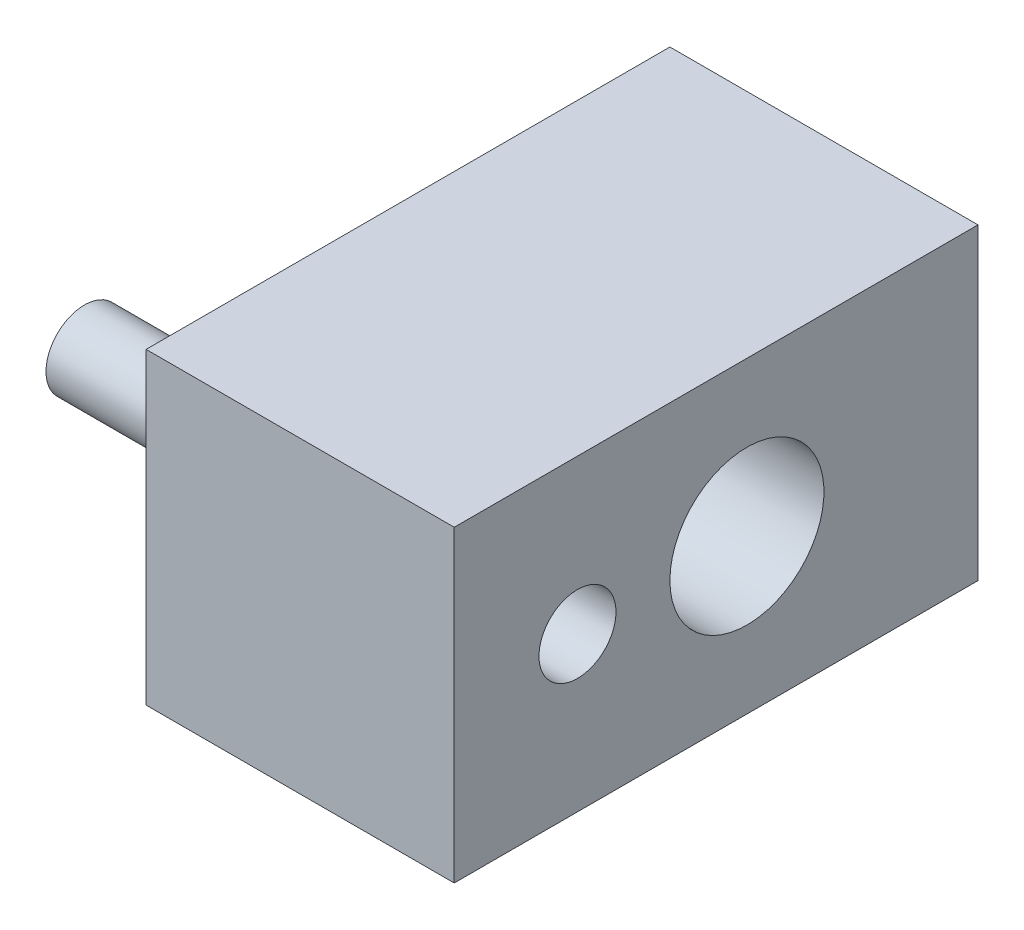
from build123d import *

# Parameters (mm, degrees)
ESQUISSE1_W               = 10
ESQUISSE1_H               = 10
EXTRUSION1_DEPTH          = 17
ESQUISSE2_R               = 2.5
ENL_V_MAT_EXTRU_1_DEPTH   = 23.113344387
TROU_TARAUD_M3X0_51_D     = 2.5
TROU_TARAUD_M4X0_71_D     = 3.3
TROU_TARAUD_M4X0_71_DEPTH = 8
TROU_TARAUD_M4X0_71_TIP   = 0.991420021
ESQUISSE5_R               = 1.25
BOSS_EXTRU_1_DEPTH        = 6


with BuildPart() as part:
    # Esquisse1 → Extrusion1 (new body)
    with BuildSketch(Plane.XY):
        with Locations((-5, 5)):
            Rectangle(ESQUISSE1_W, ESQUISSE1_H)
    extrude(amount=EXTRUSION1_DEPTH)

    # Esquisse2 → Enl_v. mat.-Extru.1 (cut, through all)
    with BuildSketch(Plane(origin=(0, 0, 0), x_dir=(0, 0, -1), z_dir=(1, 0, 0))):
        with Locations(Location((-7.5, 5, 0), (0, 0, 180))):
            Circle(ESQUISSE2_R)
    extrude(amount=-ENL_V_MAT_EXTRU_1_DEPTH, mode=Mode.SUBTRACT)

    # Trou taraud_ M3x0.51 (through all)
    with Locations(Plane(origin=(0, 5, 13), x_dir=(0, 0, 1), z_dir=(1, 0, 0))):
        with Locations((0, 0)):
            Hole(TROU_TARAUD_M3X0_51_D / 2)

    # Trou taraud_ M4x0.71
    with Locations(Plane(origin=(-5, 5, 0), x_dir=(-1, 0, 0), z_dir=(0, 0, -1))):
        with Locations((0, 0)):
            Hole(TROU_TARAUD_M4X0_71_D / 2, depth=TROU_TARAUD_M4X0_71_DEPTH)
            with Locations((0, 0, -(TROU_TARAUD_M4X0_71_DEPTH + TROU_TARAUD_M4X0_71_TIP / 2))):  # 118° drill point
                Cone(0, TROU_TARAUD_M4X0_71_D / 2, TROU_TARAUD_M4X0_71_TIP, mode=Mode.SUBTRACT)


with BuildPart() as body_2:
    # Esquisse5 → Boss.-Extru.1 (new body)
    with BuildSketch(Plane.ZY.offset(10)):
        with Locations((13, 5)):
            Circle(ESQUISSE5_R)
    extrude(amount=BOSS_EXTRU_1_DEPTH)


solid = Compound([part.part, body_2.part])
